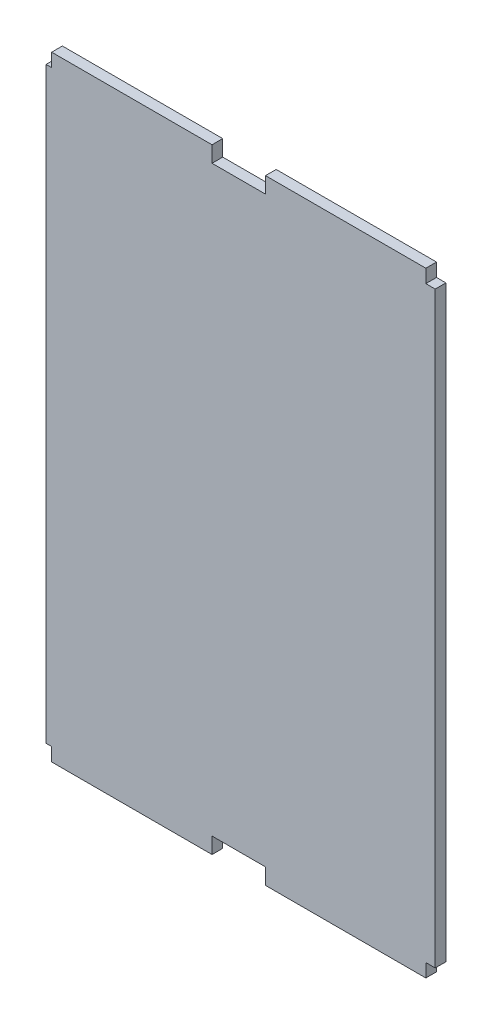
from build123d import *

# Parameters (mm, degrees)
SALIENTE_EXTRUIR1_DEPTH = 2
CROQUIS2_W              = 8.957273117
CROQUIS2_H              = 110
CROQUIS2_W_2            = 8.24777062
CORTAR_EXTRUIR1_DEPTH   = 3


with BuildPart() as part:
    # Croquis1 → Saliente-Extruir1 (new body)
    with BuildSketch(Plane.XY):
        Polygon((-45, -55), (-45, 55), (-35, 55), (-35, 57.5), (-5, 57.5), (-5, 54.5), (5, 54.5), (5, 57.5), (35, 57.5), (35, 55), (45, 55), (45, -55), (35, -55), (35, -57.5), (5, -57.5), (5, -54.5), (-5, -54.5), (-5, -57.5), (-35, -57.5), (-35, -55), align=None)
    extrude(amount=SALIENTE_EXTRUIR1_DEPTH)

    # Croquis2 → Cortar-Extruir1 (cut)
    with BuildSketch(Plane.XY.offset(2)):
        with Locations((-40.521363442, 0)):
            Rectangle(CROQUIS2_W, CROQUIS2_H)
        with Locations((40.87611469, 0)):
            Rectangle(CROQUIS2_W_2, CROQUIS2_H)
    extrude(amount=-CORTAR_EXTRUIR1_DEPTH, mode=Mode.SUBTRACT)


solid = part.part
